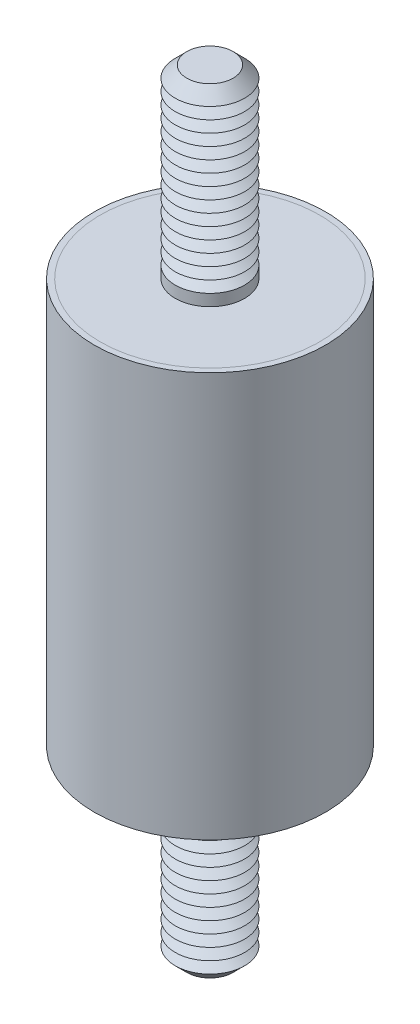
ISO-10303-21;
HEADER;
FILE_DESCRIPTION(('STEP AP214'),'2;1');
FILE_NAME('part.step','',(''),(''),'','','');
FILE_SCHEMA(('AUTOMOTIVE_DESIGN { 1 0 10303 214 1 1 1 1 }'));
ENDSEC;
DATA;
#1=APPLICATION_CONTEXT('core data for automotive mechanical design processes');
#2=APPLICATION_PROTOCOL_DEFINITION('international standard','automotive_design',2000,#1);
#3=PRODUCT_CONTEXT('',#1,'mechanical');
#4=PRODUCT('Part','Part','',(#3));
#5=PRODUCT_RELATED_PRODUCT_CATEGORY('part','',(#4));
#6=PRODUCT_DEFINITION_FORMATION('','',#4);
#7=PRODUCT_DEFINITION_CONTEXT('part definition',#1,'design');
#8=PRODUCT_DEFINITION('design','',#6,#7);
#9=PRODUCT_DEFINITION_SHAPE('','',#8);
#10=(LENGTH_UNIT() NAMED_UNIT(*) SI_UNIT(.MILLI.,.METRE.));
#11=(NAMED_UNIT(*) PLANE_ANGLE_UNIT() SI_UNIT($,.RADIAN.));
#12=(NAMED_UNIT(*) SI_UNIT($,.STERADIAN.) SOLID_ANGLE_UNIT());
#13=UNCERTAINTY_MEASURE_WITH_UNIT(LENGTH_MEASURE(1.E-05),#10,'distance_accuracy_value','');
#14=(GEOMETRIC_REPRESENTATION_CONTEXT(3) GLOBAL_UNCERTAINTY_ASSIGNED_CONTEXT((#13)) GLOBAL_UNIT_ASSIGNED_CONTEXT((#10,
#11,#12)) REPRESENTATION_CONTEXT('',''));
#15=CARTESIAN_POINT('',(0.,0.,0.));
#16=DIRECTION('',(0.,0.,1.));
#17=DIRECTION('',(1.,0.,0.));
#18=AXIS2_PLACEMENT_3D('',#15,#16,#17);
#19=CARTESIAN_POINT('',(0.,-33.5,0.));
#20=DIRECTION('',(0.,1.,0.));
#21=DIRECTION('',(0.,0.,1.));
#22=AXIS2_PLACEMENT_3D('',#19,#20,#21);
#23=CYLINDRICAL_SURFACE('',#22,3.);
#24=CARTESIAN_POINT('',(0.,-17.5,0.));
#25=DIRECTION('',(0.,-1.,0.));
#26=DIRECTION('',(0.,0.,-1.));
#27=AXIS2_PLACEMENT_3D('',#24,#25,#26);
#28=CIRCLE('',#27,3.);
#29=CARTESIAN_POINT('',(0.,-17.5,-3.));
#30=VERTEX_POINT('',#29);
#31=EDGE_CURVE('P0_E21',#30,#30,#28,.T.);
#32=ORIENTED_EDGE('',*,*,#31,.T.);
#33=EDGE_LOOP('',(#32));
#34=FACE_BOUND('',#33,.T.);
#35=CARTESIAN_POINT('',(0.,-18.5,0.));
#36=DIRECTION('',(0.,1.,0.));
#37=DIRECTION('',(0.,0.,1.));
#38=AXIS2_PLACEMENT_3D('',#35,#36,#37);
#39=CIRCLE('',#38,3.);
#40=CARTESIAN_POINT('',(0.,-18.5,3.));
#41=VERTEX_POINT('',#40);
#42=EDGE_CURVE('P0_E33',#41,#41,#39,.T.);
#43=ORIENTED_EDGE('',*,*,#42,.T.);
#44=EDGE_LOOP('',(#43));
#45=FACE_BOUND('',#44,.T.);
#46=ADVANCED_FACE('P0_F14',(#34,#45),#23,.T.);
#47=CARTESIAN_POINT('',(0.,-17.5,0.));
#48=DIRECTION('',(0.,1.,0.));
#49=DIRECTION('',(0.,0.,1.));
#50=AXIS2_PLACEMENT_3D('',#47,#48,#49);
#51=CYLINDRICAL_SURFACE('',#50,9.5);
#52=CARTESIAN_POINT('',(0.,-17.5,0.));
#53=DIRECTION('',(0.,1.,0.));
#54=DIRECTION('',(0.,0.,1.));
#55=AXIS2_PLACEMENT_3D('',#52,#53,#54);
#56=CIRCLE('',#55,9.5);
#57=CARTESIAN_POINT('',(0.,-17.5,9.5));
#58=VERTEX_POINT('',#57);
#59=EDGE_CURVE('P0_E25',#58,#58,#56,.T.);
#60=ORIENTED_EDGE('',*,*,#59,.T.);
#61=EDGE_LOOP('',(#60));
#62=FACE_BOUND('',#61,.T.);
#63=CARTESIAN_POINT('',(0.,-16.,0.));
#64=DIRECTION('',(0.,1.,0.));
#65=DIRECTION('',(0.,0.,1.));
#66=AXIS2_PLACEMENT_3D('',#63,#64,#65);
#67=CIRCLE('',#66,9.5);
#68=CARTESIAN_POINT('',(0.,-16.,9.5));
#69=VERTEX_POINT('',#68);
#70=EDGE_CURVE('P0_E30',#69,#69,#67,.T.);
#71=ORIENTED_EDGE('',*,*,#70,.F.);
#72=EDGE_LOOP('',(#71));
#73=FACE_BOUND('',#72,.T.);
#74=ADVANCED_FACE('P0_F145',(#62,#73),#51,.T.);
#75=CARTESIAN_POINT('',(0.,-17.5,0.));
#76=DIRECTION('',(0.,1.,0.));
#77=DIRECTION('',(0.,0.,1.));
#78=AXIS2_PLACEMENT_3D('',#75,#76,#77);
#79=PLANE('',#78);
#80=ORIENTED_EDGE('',*,*,#31,.F.);
#81=EDGE_LOOP('',(#80));
#82=FACE_BOUND('',#81,.T.);
#83=ORIENTED_EDGE('',*,*,#59,.F.);
#84=EDGE_LOOP('',(#83));
#85=FACE_BOUND('',#84,.T.);
#86=ADVANCED_FACE('P0_F150',(#82,#85),#79,.F.);
#87=CARTESIAN_POINT('',(0.,-16.,0.));
#88=DIRECTION('',(0.,1.,0.));
#89=DIRECTION('',(0.,0.,1.));
#90=AXIS2_PLACEMENT_3D('',#87,#88,#89);
#91=PLANE('',#90);
#92=ORIENTED_EDGE('',*,*,#70,.T.);
#93=EDGE_LOOP('',(#92));
#94=FACE_BOUND('',#93,.T.);
#95=ADVANCED_FACE('P0_F156',(#94),#91,.T.);
#96=CARTESIAN_POINT('',(0.,-18.5,0.));
#97=DIRECTION('',(0.,1.,0.));
#98=DIRECTION('',(0.,0.,1.));
#99=AXIS2_PLACEMENT_3D('',#96,#97,#98);
#100=CONICAL_SURFACE('',#99,3.,1.0471975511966);
#101=CARTESIAN_POINT('',(0.,-19.,0.));
#102=DIRECTION('',(0.,1.,0.));
#103=DIRECTION('',(0.,0.,1.));
#104=AXIS2_PLACEMENT_3D('',#101,#102,#103);
#105=CIRCLE('',#104,2.13397459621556);
#106=CARTESIAN_POINT('',(0.,-19.,2.13397459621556));
#107=VERTEX_POINT('',#106);
#108=EDGE_CURVE('P0_E39',#107,#107,#105,.T.);
#109=ORIENTED_EDGE('',*,*,#108,.T.);
#110=EDGE_LOOP('',(#109));
#111=FACE_BOUND('',#110,.T.);
#112=ORIENTED_EDGE('',*,*,#42,.F.);
#113=EDGE_LOOP('',(#112));
#114=FACE_BOUND('',#113,.T.);
#115=ADVANCED_FACE('P0_F159',(#111,#114),#100,.T.);
#116=CARTESIAN_POINT('',(0.,-19.,0.));
#117=DIRECTION('',(0.,-1.,0.));
#118=DIRECTION('',(0.,0.,-1.));
#119=AXIS2_PLACEMENT_3D('',#116,#117,#118);
#120=CONICAL_SURFACE('',#119,2.13397459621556,1.0471975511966);
#121=CARTESIAN_POINT('',(0.,-19.5,0.));
#122=DIRECTION('',(0.,1.,0.));
#123=DIRECTION('',(0.,0.,1.));
#124=AXIS2_PLACEMENT_3D('',#121,#122,#123);
#125=CIRCLE('',#124,3.);
#126=CARTESIAN_POINT('',(0.,-19.5,3.));
#127=VERTEX_POINT('',#126);
#128=EDGE_CURVE('P0_E43',#127,#127,#125,.T.);
#129=ORIENTED_EDGE('',*,*,#128,.T.);
#130=EDGE_LOOP('',(#129));
#131=FACE_BOUND('',#130,.T.);
#132=ORIENTED_EDGE('',*,*,#108,.F.);
#133=EDGE_LOOP('',(#132));
#134=FACE_BOUND('',#133,.T.);
#135=ADVANCED_FACE('P0_F163',(#131,#134),#120,.T.);
#136=CARTESIAN_POINT('',(0.,-19.5,0.));
#137=DIRECTION('',(0.,1.,0.));
#138=DIRECTION('',(0.,0.,1.));
#139=AXIS2_PLACEMENT_3D('',#136,#137,#138);
#140=CONICAL_SURFACE('',#139,3.,1.0471975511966);
#141=CARTESIAN_POINT('',(0.,-20.,0.));
#142=DIRECTION('',(0.,1.,0.));
#143=DIRECTION('',(0.,0.,1.));
#144=AXIS2_PLACEMENT_3D('',#141,#142,#143);
#145=CIRCLE('',#144,2.13397459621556);
#146=CARTESIAN_POINT('',(0.,-20.,2.13397459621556));
#147=VERTEX_POINT('',#146);
#148=EDGE_CURVE('P0_E47',#147,#147,#145,.T.);
#149=ORIENTED_EDGE('',*,*,#148,.T.);
#150=EDGE_LOOP('',(#149));
#151=FACE_BOUND('',#150,.T.);
#152=ORIENTED_EDGE('',*,*,#128,.F.);
#153=EDGE_LOOP('',(#152));
#154=FACE_BOUND('',#153,.T.);
#155=ADVANCED_FACE('P0_F167',(#151,#154),#140,.T.);
#156=CARTESIAN_POINT('',(0.,-20.,0.));
#157=DIRECTION('',(0.,-1.,0.));
#158=DIRECTION('',(0.,0.,-1.));
#159=AXIS2_PLACEMENT_3D('',#156,#157,#158);
#160=CONICAL_SURFACE('',#159,2.13397459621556,1.0471975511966);
#161=CARTESIAN_POINT('',(0.,-20.5,0.));
#162=DIRECTION('',(0.,1.,0.));
#163=DIRECTION('',(0.,0.,1.));
#164=AXIS2_PLACEMENT_3D('',#161,#162,#163);
#165=CIRCLE('',#164,3.);
#166=CARTESIAN_POINT('',(0.,-20.5,3.));
#167=VERTEX_POINT('',#166);
#168=EDGE_CURVE('P0_E52',#167,#167,#165,.T.);
#169=ORIENTED_EDGE('',*,*,#168,.T.);
#170=EDGE_LOOP('',(#169));
#171=FACE_BOUND('',#170,.T.);
#172=ORIENTED_EDGE('',*,*,#148,.F.);
#173=EDGE_LOOP('',(#172));
#174=FACE_BOUND('',#173,.T.);
#175=ADVANCED_FACE('P0_F174',(#171,#174),#160,.T.);
#176=CARTESIAN_POINT('',(0.,-20.5,0.));
#177=DIRECTION('',(0.,1.,0.));
#178=DIRECTION('',(0.,0.,1.));
#179=AXIS2_PLACEMENT_3D('',#176,#177,#178);
#180=CONICAL_SURFACE('',#179,3.,1.0471975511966);
#181=CARTESIAN_POINT('',(0.,-21.,0.));
#182=DIRECTION('',(0.,1.,0.));
#183=DIRECTION('',(0.,0.,1.));
#184=AXIS2_PLACEMENT_3D('',#181,#182,#183);
#185=CIRCLE('',#184,2.13397459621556);
#186=CARTESIAN_POINT('',(0.,-21.,2.13397459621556));
#187=VERTEX_POINT('',#186);
#188=EDGE_CURVE('P0_E55',#187,#187,#185,.T.);
#189=ORIENTED_EDGE('',*,*,#188,.T.);
#190=EDGE_LOOP('',(#189));
#191=FACE_BOUND('',#190,.T.);
#192=ORIENTED_EDGE('',*,*,#168,.F.);
#193=EDGE_LOOP('',(#192));
#194=FACE_BOUND('',#193,.T.);
#195=ADVANCED_FACE('P0_F178',(#191,#194),#180,.T.);
#196=CARTESIAN_POINT('',(0.,-21.,0.));
#197=DIRECTION('',(0.,-1.,0.));
#198=DIRECTION('',(0.,0.,-1.));
#199=AXIS2_PLACEMENT_3D('',#196,#197,#198);
#200=CONICAL_SURFACE('',#199,2.13397459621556,1.0471975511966);
#201=CARTESIAN_POINT('',(0.,-21.5,0.));
#202=DIRECTION('',(0.,1.,0.));
#203=DIRECTION('',(0.,0.,1.));
#204=AXIS2_PLACEMENT_3D('',#201,#202,#203);
#205=CIRCLE('',#204,3.);
#206=CARTESIAN_POINT('',(0.,-21.5,3.));
#207=VERTEX_POINT('',#206);
#208=EDGE_CURVE('P0_E58',#207,#207,#205,.T.);
#209=ORIENTED_EDGE('',*,*,#208,.T.);
#210=EDGE_LOOP('',(#209));
#211=FACE_BOUND('',#210,.T.);
#212=ORIENTED_EDGE('',*,*,#188,.F.);
#213=EDGE_LOOP('',(#212));
#214=FACE_BOUND('',#213,.T.);
#215=ADVANCED_FACE('P0_F182',(#211,#214),#200,.T.);
#216=CARTESIAN_POINT('',(0.,-21.5,0.));
#217=DIRECTION('',(0.,1.,0.));
#218=DIRECTION('',(0.,0.,1.));
#219=AXIS2_PLACEMENT_3D('',#216,#217,#218);
#220=CONICAL_SURFACE('',#219,3.,1.0471975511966);
#221=CARTESIAN_POINT('',(0.,-22.,0.));
#222=DIRECTION('',(0.,1.,0.));
#223=DIRECTION('',(0.,0.,1.));
#224=AXIS2_PLACEMENT_3D('',#221,#222,#223);
#225=CIRCLE('',#224,2.13397459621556);
#226=CARTESIAN_POINT('',(0.,-22.,2.13397459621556));
#227=VERTEX_POINT('',#226);
#228=EDGE_CURVE('P0_E61',#227,#227,#225,.T.);
#229=ORIENTED_EDGE('',*,*,#228,.T.);
#230=EDGE_LOOP('',(#229));
#231=FACE_BOUND('',#230,.T.);
#232=ORIENTED_EDGE('',*,*,#208,.F.);
#233=EDGE_LOOP('',(#232));
#234=FACE_BOUND('',#233,.T.);
#235=ADVANCED_FACE('P0_F186',(#231,#234),#220,.T.);
#236=CARTESIAN_POINT('',(0.,-22.,0.));
#237=DIRECTION('',(0.,-1.,0.));
#238=DIRECTION('',(0.,0.,-1.));
#239=AXIS2_PLACEMENT_3D('',#236,#237,#238);
#240=CONICAL_SURFACE('',#239,2.13397459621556,1.0471975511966);
#241=CARTESIAN_POINT('',(0.,-22.5,0.));
#242=DIRECTION('',(0.,1.,0.));
#243=DIRECTION('',(0.,0.,1.));
#244=AXIS2_PLACEMENT_3D('',#241,#242,#243);
#245=CIRCLE('',#244,3.);
#246=CARTESIAN_POINT('',(0.,-22.5,3.));
#247=VERTEX_POINT('',#246);
#248=EDGE_CURVE('P0_E64',#247,#247,#245,.T.);
#249=ORIENTED_EDGE('',*,*,#248,.T.);
#250=EDGE_LOOP('',(#249));
#251=FACE_BOUND('',#250,.T.);
#252=ORIENTED_EDGE('',*,*,#228,.F.);
#253=EDGE_LOOP('',(#252));
#254=FACE_BOUND('',#253,.T.);
#255=ADVANCED_FACE('P0_F190',(#251,#254),#240,.T.);
#256=CARTESIAN_POINT('',(0.,-22.5,0.));
#257=DIRECTION('',(0.,1.,0.));
#258=DIRECTION('',(0.,0.,1.));
#259=AXIS2_PLACEMENT_3D('',#256,#257,#258);
#260=CONICAL_SURFACE('',#259,3.,1.0471975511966);
#261=CARTESIAN_POINT('',(0.,-23.,0.));
#262=DIRECTION('',(0.,1.,0.));
#263=DIRECTION('',(0.,0.,1.));
#264=AXIS2_PLACEMENT_3D('',#261,#262,#263);
#265=CIRCLE('',#264,2.13397459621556);
#266=CARTESIAN_POINT('',(0.,-23.,2.13397459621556));
#267=VERTEX_POINT('',#266);
#268=EDGE_CURVE('P0_E67',#267,#267,#265,.T.);
#269=ORIENTED_EDGE('',*,*,#268,.T.);
#270=EDGE_LOOP('',(#269));
#271=FACE_BOUND('',#270,.T.);
#272=ORIENTED_EDGE('',*,*,#248,.F.);
#273=EDGE_LOOP('',(#272));
#274=FACE_BOUND('',#273,.T.);
#275=ADVANCED_FACE('P0_F194',(#271,#274),#260,.T.);
#276=CARTESIAN_POINT('',(0.,-23.,0.));
#277=DIRECTION('',(0.,-1.,0.));
#278=DIRECTION('',(0.,0.,-1.));
#279=AXIS2_PLACEMENT_3D('',#276,#277,#278);
#280=CONICAL_SURFACE('',#279,2.13397459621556,1.0471975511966);
#281=CARTESIAN_POINT('',(0.,-23.5,0.));
#282=DIRECTION('',(0.,1.,0.));
#283=DIRECTION('',(0.,0.,1.));
#284=AXIS2_PLACEMENT_3D('',#281,#282,#283);
#285=CIRCLE('',#284,3.);
#286=CARTESIAN_POINT('',(0.,-23.5,3.));
#287=VERTEX_POINT('',#286);
#288=EDGE_CURVE('P0_E70',#287,#287,#285,.T.);
#289=ORIENTED_EDGE('',*,*,#288,.T.);
#290=EDGE_LOOP('',(#289));
#291=FACE_BOUND('',#290,.T.);
#292=ORIENTED_EDGE('',*,*,#268,.F.);
#293=EDGE_LOOP('',(#292));
#294=FACE_BOUND('',#293,.T.);
#295=ADVANCED_FACE('P0_F198',(#291,#294),#280,.T.);
#296=CARTESIAN_POINT('',(0.,-23.5,0.));
#297=DIRECTION('',(0.,1.,0.));
#298=DIRECTION('',(0.,0.,1.));
#299=AXIS2_PLACEMENT_3D('',#296,#297,#298);
#300=CONICAL_SURFACE('',#299,3.,1.0471975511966);
#301=CARTESIAN_POINT('',(0.,-24.,0.));
#302=DIRECTION('',(0.,1.,0.));
#303=DIRECTION('',(0.,0.,1.));
#304=AXIS2_PLACEMENT_3D('',#301,#302,#303);
#305=CIRCLE('',#304,2.13397459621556);
#306=CARTESIAN_POINT('',(0.,-24.,2.13397459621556));
#307=VERTEX_POINT('',#306);
#308=EDGE_CURVE('P0_E73',#307,#307,#305,.T.);
#309=ORIENTED_EDGE('',*,*,#308,.T.);
#310=EDGE_LOOP('',(#309));
#311=FACE_BOUND('',#310,.T.);
#312=ORIENTED_EDGE('',*,*,#288,.F.);
#313=EDGE_LOOP('',(#312));
#314=FACE_BOUND('',#313,.T.);
#315=ADVANCED_FACE('P0_F202',(#311,#314),#300,.T.);
#316=CARTESIAN_POINT('',(0.,-24.,0.));
#317=DIRECTION('',(0.,-1.,0.));
#318=DIRECTION('',(0.,0.,-1.));
#319=AXIS2_PLACEMENT_3D('',#316,#317,#318);
#320=CONICAL_SURFACE('',#319,2.13397459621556,1.0471975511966);
#321=CARTESIAN_POINT('',(0.,-24.5,0.));
#322=DIRECTION('',(0.,1.,0.));
#323=DIRECTION('',(0.,0.,1.));
#324=AXIS2_PLACEMENT_3D('',#321,#322,#323);
#325=CIRCLE('',#324,3.);
#326=CARTESIAN_POINT('',(0.,-24.5,3.));
#327=VERTEX_POINT('',#326);
#328=EDGE_CURVE('P0_E76',#327,#327,#325,.T.);
#329=ORIENTED_EDGE('',*,*,#328,.T.);
#330=EDGE_LOOP('',(#329));
#331=FACE_BOUND('',#330,.T.);
#332=ORIENTED_EDGE('',*,*,#308,.F.);
#333=EDGE_LOOP('',(#332));
#334=FACE_BOUND('',#333,.T.);
#335=ADVANCED_FACE('P0_F206',(#331,#334),#320,.T.);
#336=CARTESIAN_POINT('',(0.,-24.5,0.));
#337=DIRECTION('',(0.,1.,0.));
#338=DIRECTION('',(0.,0.,1.));
#339=AXIS2_PLACEMENT_3D('',#336,#337,#338);
#340=CONICAL_SURFACE('',#339,3.,1.0471975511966);
#341=CARTESIAN_POINT('',(0.,-25.,0.));
#342=DIRECTION('',(0.,1.,0.));
#343=DIRECTION('',(0.,0.,1.));
#344=AXIS2_PLACEMENT_3D('',#341,#342,#343);
#345=CIRCLE('',#344,2.13397459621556);
#346=CARTESIAN_POINT('',(0.,-25.,2.13397459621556));
#347=VERTEX_POINT('',#346);
#348=EDGE_CURVE('P0_E79',#347,#347,#345,.T.);
#349=ORIENTED_EDGE('',*,*,#348,.T.);
#350=EDGE_LOOP('',(#349));
#351=FACE_BOUND('',#350,.T.);
#352=ORIENTED_EDGE('',*,*,#328,.F.);
#353=EDGE_LOOP('',(#352));
#354=FACE_BOUND('',#353,.T.);
#355=ADVANCED_FACE('P0_F210',(#351,#354),#340,.T.);
#356=CARTESIAN_POINT('',(0.,-25.,0.));
#357=DIRECTION('',(0.,-1.,0.));
#358=DIRECTION('',(0.,0.,-1.));
#359=AXIS2_PLACEMENT_3D('',#356,#357,#358);
#360=CONICAL_SURFACE('',#359,2.13397459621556,1.0471975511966);
#361=CARTESIAN_POINT('',(0.,-25.5,0.));
#362=DIRECTION('',(0.,1.,0.));
#363=DIRECTION('',(0.,0.,1.));
#364=AXIS2_PLACEMENT_3D('',#361,#362,#363);
#365=CIRCLE('',#364,3.);
#366=CARTESIAN_POINT('',(0.,-25.5,3.));
#367=VERTEX_POINT('',#366);
#368=EDGE_CURVE('P0_E82',#367,#367,#365,.T.);
#369=ORIENTED_EDGE('',*,*,#368,.T.);
#370=EDGE_LOOP('',(#369));
#371=FACE_BOUND('',#370,.T.);
#372=ORIENTED_EDGE('',*,*,#348,.F.);
#373=EDGE_LOOP('',(#372));
#374=FACE_BOUND('',#373,.T.);
#375=ADVANCED_FACE('P0_F214',(#371,#374),#360,.T.);
#376=CARTESIAN_POINT('',(0.,-25.5,0.));
#377=DIRECTION('',(0.,1.,0.));
#378=DIRECTION('',(0.,0.,1.));
#379=AXIS2_PLACEMENT_3D('',#376,#377,#378);
#380=CONICAL_SURFACE('',#379,3.,1.0471975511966);
#381=CARTESIAN_POINT('',(0.,-26.,0.));
#382=DIRECTION('',(0.,1.,0.));
#383=DIRECTION('',(0.,0.,1.));
#384=AXIS2_PLACEMENT_3D('',#381,#382,#383);
#385=CIRCLE('',#384,2.13397459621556);
#386=CARTESIAN_POINT('',(0.,-26.,2.13397459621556));
#387=VERTEX_POINT('',#386);
#388=EDGE_CURVE('P0_E85',#387,#387,#385,.T.);
#389=ORIENTED_EDGE('',*,*,#388,.T.);
#390=EDGE_LOOP('',(#389));
#391=FACE_BOUND('',#390,.T.);
#392=ORIENTED_EDGE('',*,*,#368,.F.);
#393=EDGE_LOOP('',(#392));
#394=FACE_BOUND('',#393,.T.);
#395=ADVANCED_FACE('P0_F218',(#391,#394),#380,.T.);
#396=CARTESIAN_POINT('',(0.,-26.,0.));
#397=DIRECTION('',(0.,-1.,0.));
#398=DIRECTION('',(0.,0.,-1.));
#399=AXIS2_PLACEMENT_3D('',#396,#397,#398);
#400=CONICAL_SURFACE('',#399,2.13397459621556,1.0471975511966);
#401=CARTESIAN_POINT('',(0.,-26.5,0.));
#402=DIRECTION('',(0.,1.,0.));
#403=DIRECTION('',(0.,0.,1.));
#404=AXIS2_PLACEMENT_3D('',#401,#402,#403);
#405=CIRCLE('',#404,3.);
#406=CARTESIAN_POINT('',(0.,-26.5,3.));
#407=VERTEX_POINT('',#406);
#408=EDGE_CURVE('P0_E88',#407,#407,#405,.T.);
#409=ORIENTED_EDGE('',*,*,#408,.T.);
#410=EDGE_LOOP('',(#409));
#411=FACE_BOUND('',#410,.T.);
#412=ORIENTED_EDGE('',*,*,#388,.F.);
#413=EDGE_LOOP('',(#412));
#414=FACE_BOUND('',#413,.T.);
#415=ADVANCED_FACE('P0_F222',(#411,#414),#400,.T.);
#416=CARTESIAN_POINT('',(0.,-26.5,0.));
#417=DIRECTION('',(0.,1.,0.));
#418=DIRECTION('',(0.,0.,1.));
#419=AXIS2_PLACEMENT_3D('',#416,#417,#418);
#420=CONICAL_SURFACE('',#419,3.,1.0471975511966);
#421=CARTESIAN_POINT('',(0.,-27.,0.));
#422=DIRECTION('',(0.,1.,0.));
#423=DIRECTION('',(0.,0.,1.));
#424=AXIS2_PLACEMENT_3D('',#421,#422,#423);
#425=CIRCLE('',#424,2.13397459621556);
#426=CARTESIAN_POINT('',(0.,-27.,2.13397459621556));
#427=VERTEX_POINT('',#426);
#428=EDGE_CURVE('P0_E91',#427,#427,#425,.T.);
#429=ORIENTED_EDGE('',*,*,#428,.T.);
#430=EDGE_LOOP('',(#429));
#431=FACE_BOUND('',#430,.T.);
#432=ORIENTED_EDGE('',*,*,#408,.F.);
#433=EDGE_LOOP('',(#432));
#434=FACE_BOUND('',#433,.T.);
#435=ADVANCED_FACE('P0_F226',(#431,#434),#420,.T.);
#436=CARTESIAN_POINT('',(0.,-27.,0.));
#437=DIRECTION('',(0.,-1.,0.));
#438=DIRECTION('',(0.,0.,-1.));
#439=AXIS2_PLACEMENT_3D('',#436,#437,#438);
#440=CONICAL_SURFACE('',#439,2.13397459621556,1.0471975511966);
#441=CARTESIAN_POINT('',(0.,-27.5,0.));
#442=DIRECTION('',(0.,1.,0.));
#443=DIRECTION('',(0.,0.,1.));
#444=AXIS2_PLACEMENT_3D('',#441,#442,#443);
#445=CIRCLE('',#444,3.);
#446=CARTESIAN_POINT('',(0.,-27.5,3.));
#447=VERTEX_POINT('',#446);
#448=EDGE_CURVE('P0_E94',#447,#447,#445,.T.);
#449=ORIENTED_EDGE('',*,*,#448,.T.);
#450=EDGE_LOOP('',(#449));
#451=FACE_BOUND('',#450,.T.);
#452=ORIENTED_EDGE('',*,*,#428,.F.);
#453=EDGE_LOOP('',(#452));
#454=FACE_BOUND('',#453,.T.);
#455=ADVANCED_FACE('P0_F230',(#451,#454),#440,.T.);
#456=CARTESIAN_POINT('',(0.,-27.5,0.));
#457=DIRECTION('',(0.,1.,0.));
#458=DIRECTION('',(0.,0.,1.));
#459=AXIS2_PLACEMENT_3D('',#456,#457,#458);
#460=CONICAL_SURFACE('',#459,3.,1.0471975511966);
#461=CARTESIAN_POINT('',(0.,-28.,0.));
#462=DIRECTION('',(0.,1.,0.));
#463=DIRECTION('',(0.,0.,1.));
#464=AXIS2_PLACEMENT_3D('',#461,#462,#463);
#465=CIRCLE('',#464,2.13397459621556);
#466=CARTESIAN_POINT('',(0.,-28.,2.13397459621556));
#467=VERTEX_POINT('',#466);
#468=EDGE_CURVE('P0_E97',#467,#467,#465,.T.);
#469=ORIENTED_EDGE('',*,*,#468,.T.);
#470=EDGE_LOOP('',(#469));
#471=FACE_BOUND('',#470,.T.);
#472=ORIENTED_EDGE('',*,*,#448,.F.);
#473=EDGE_LOOP('',(#472));
#474=FACE_BOUND('',#473,.T.);
#475=ADVANCED_FACE('P0_F234',(#471,#474),#460,.T.);
#476=CARTESIAN_POINT('',(0.,-28.,0.));
#477=DIRECTION('',(0.,-1.,0.));
#478=DIRECTION('',(0.,0.,-1.));
#479=AXIS2_PLACEMENT_3D('',#476,#477,#478);
#480=CONICAL_SURFACE('',#479,2.13397459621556,1.0471975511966);
#481=CARTESIAN_POINT('',(0.,-28.5,0.));
#482=DIRECTION('',(0.,1.,0.));
#483=DIRECTION('',(0.,0.,1.));
#484=AXIS2_PLACEMENT_3D('',#481,#482,#483);
#485=CIRCLE('',#484,3.);
#486=CARTESIAN_POINT('',(0.,-28.5,3.));
#487=VERTEX_POINT('',#486);
#488=EDGE_CURVE('P0_E100',#487,#487,#485,.T.);
#489=ORIENTED_EDGE('',*,*,#488,.T.);
#490=EDGE_LOOP('',(#489));
#491=FACE_BOUND('',#490,.T.);
#492=ORIENTED_EDGE('',*,*,#468,.F.);
#493=EDGE_LOOP('',(#492));
#494=FACE_BOUND('',#493,.T.);
#495=ADVANCED_FACE('P0_F238',(#491,#494),#480,.T.);
#496=CARTESIAN_POINT('',(0.,-28.5,0.));
#497=DIRECTION('',(0.,1.,0.));
#498=DIRECTION('',(0.,0.,1.));
#499=AXIS2_PLACEMENT_3D('',#496,#497,#498);
#500=CONICAL_SURFACE('',#499,3.,1.0471975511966);
#501=CARTESIAN_POINT('',(0.,-29.,0.));
#502=DIRECTION('',(0.,1.,0.));
#503=DIRECTION('',(0.,0.,1.));
#504=AXIS2_PLACEMENT_3D('',#501,#502,#503);
#505=CIRCLE('',#504,2.13397459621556);
#506=CARTESIAN_POINT('',(0.,-29.,2.13397459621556));
#507=VERTEX_POINT('',#506);
#508=EDGE_CURVE('P0_E103',#507,#507,#505,.T.);
#509=ORIENTED_EDGE('',*,*,#508,.T.);
#510=EDGE_LOOP('',(#509));
#511=FACE_BOUND('',#510,.T.);
#512=ORIENTED_EDGE('',*,*,#488,.F.);
#513=EDGE_LOOP('',(#512));
#514=FACE_BOUND('',#513,.T.);
#515=ADVANCED_FACE('P0_F242',(#511,#514),#500,.T.);
#516=CARTESIAN_POINT('',(0.,-29.,0.));
#517=DIRECTION('',(0.,-1.,0.));
#518=DIRECTION('',(0.,0.,-1.));
#519=AXIS2_PLACEMENT_3D('',#516,#517,#518);
#520=CONICAL_SURFACE('',#519,2.13397459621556,1.0471975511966);
#521=CARTESIAN_POINT('',(0.,-29.5,0.));
#522=DIRECTION('',(0.,1.,0.));
#523=DIRECTION('',(0.,0.,1.));
#524=AXIS2_PLACEMENT_3D('',#521,#522,#523);
#525=CIRCLE('',#524,3.);
#526=CARTESIAN_POINT('',(0.,-29.5,3.));
#527=VERTEX_POINT('',#526);
#528=EDGE_CURVE('P0_E106',#527,#527,#525,.T.);
#529=ORIENTED_EDGE('',*,*,#528,.T.);
#530=EDGE_LOOP('',(#529));
#531=FACE_BOUND('',#530,.T.);
#532=ORIENTED_EDGE('',*,*,#508,.F.);
#533=EDGE_LOOP('',(#532));
#534=FACE_BOUND('',#533,.T.);
#535=ADVANCED_FACE('P0_F246',(#531,#534),#520,.T.);
#536=CARTESIAN_POINT('',(0.,-29.5,0.));
#537=DIRECTION('',(0.,1.,0.));
#538=DIRECTION('',(0.,0.,1.));
#539=AXIS2_PLACEMENT_3D('',#536,#537,#538);
#540=CONICAL_SURFACE('',#539,3.,1.0471975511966);
#541=CARTESIAN_POINT('',(0.,-30.,0.));
#542=DIRECTION('',(0.,1.,0.));
#543=DIRECTION('',(0.,0.,1.));
#544=AXIS2_PLACEMENT_3D('',#541,#542,#543);
#545=CIRCLE('',#544,2.13397459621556);
#546=CARTESIAN_POINT('',(0.,-30.,2.13397459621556));
#547=VERTEX_POINT('',#546);
#548=EDGE_CURVE('P0_E109',#547,#547,#545,.T.);
#549=ORIENTED_EDGE('',*,*,#548,.T.);
#550=EDGE_LOOP('',(#549));
#551=FACE_BOUND('',#550,.T.);
#552=ORIENTED_EDGE('',*,*,#528,.F.);
#553=EDGE_LOOP('',(#552));
#554=FACE_BOUND('',#553,.T.);
#555=ADVANCED_FACE('P0_F250',(#551,#554),#540,.T.);
#556=CARTESIAN_POINT('',(0.,-30.,0.));
#557=DIRECTION('',(0.,-1.,0.));
#558=DIRECTION('',(0.,0.,-1.));
#559=AXIS2_PLACEMENT_3D('',#556,#557,#558);
#560=CONICAL_SURFACE('',#559,2.13397459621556,1.0471975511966);
#561=CARTESIAN_POINT('',(0.,-30.5,0.));
#562=DIRECTION('',(0.,1.,0.));
#563=DIRECTION('',(0.,0.,1.));
#564=AXIS2_PLACEMENT_3D('',#561,#562,#563);
#565=CIRCLE('',#564,3.);
#566=CARTESIAN_POINT('',(0.,-30.5,3.));
#567=VERTEX_POINT('',#566);
#568=EDGE_CURVE('P0_E112',#567,#567,#565,.T.);
#569=ORIENTED_EDGE('',*,*,#568,.T.);
#570=EDGE_LOOP('',(#569));
#571=FACE_BOUND('',#570,.T.);
#572=ORIENTED_EDGE('',*,*,#548,.F.);
#573=EDGE_LOOP('',(#572));
#574=FACE_BOUND('',#573,.T.);
#575=ADVANCED_FACE('P0_F254',(#571,#574),#560,.T.);
#576=CARTESIAN_POINT('',(0.,-30.5,0.));
#577=DIRECTION('',(0.,1.,0.));
#578=DIRECTION('',(0.,0.,1.));
#579=AXIS2_PLACEMENT_3D('',#576,#577,#578);
#580=CONICAL_SURFACE('',#579,3.,1.0471975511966);
#581=CARTESIAN_POINT('',(0.,-31.,0.));
#582=DIRECTION('',(0.,1.,0.));
#583=DIRECTION('',(0.,0.,1.));
#584=AXIS2_PLACEMENT_3D('',#581,#582,#583);
#585=CIRCLE('',#584,2.13397459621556);
#586=CARTESIAN_POINT('',(0.,-31.,2.13397459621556));
#587=VERTEX_POINT('',#586);
#588=EDGE_CURVE('P0_E115',#587,#587,#585,.T.);
#589=ORIENTED_EDGE('',*,*,#588,.T.);
#590=EDGE_LOOP('',(#589));
#591=FACE_BOUND('',#590,.T.);
#592=ORIENTED_EDGE('',*,*,#568,.F.);
#593=EDGE_LOOP('',(#592));
#594=FACE_BOUND('',#593,.T.);
#595=ADVANCED_FACE('P0_F258',(#591,#594),#580,.T.);
#596=CARTESIAN_POINT('',(0.,-31.,0.));
#597=DIRECTION('',(0.,-1.,0.));
#598=DIRECTION('',(0.,0.,-1.));
#599=AXIS2_PLACEMENT_3D('',#596,#597,#598);
#600=CONICAL_SURFACE('',#599,2.13397459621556,1.0471975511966);
#601=CARTESIAN_POINT('',(0.,-31.5,0.));
#602=DIRECTION('',(0.,1.,0.));
#603=DIRECTION('',(0.,0.,1.));
#604=AXIS2_PLACEMENT_3D('',#601,#602,#603);
#605=CIRCLE('',#604,3.);
#606=CARTESIAN_POINT('',(0.,-31.5,3.));
#607=VERTEX_POINT('',#606);
#608=EDGE_CURVE('P0_E118',#607,#607,#605,.T.);
#609=ORIENTED_EDGE('',*,*,#608,.T.);
#610=EDGE_LOOP('',(#609));
#611=FACE_BOUND('',#610,.T.);
#612=ORIENTED_EDGE('',*,*,#588,.F.);
#613=EDGE_LOOP('',(#612));
#614=FACE_BOUND('',#613,.T.);
#615=ADVANCED_FACE('P0_F142',(#611,#614),#600,.T.);
#616=CARTESIAN_POINT('',(0.,-31.5,0.));
#617=DIRECTION('',(0.,1.,0.));
#618=DIRECTION('',(0.,0.,1.));
#619=AXIS2_PLACEMENT_3D('',#616,#617,#618);
#620=CONICAL_SURFACE('',#619,3.,1.0471975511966);
#621=CARTESIAN_POINT('',(0.,-32.,0.));
#622=DIRECTION('',(0.,1.,0.));
#623=DIRECTION('',(0.,0.,1.));
#624=AXIS2_PLACEMENT_3D('',#621,#622,#623);
#625=CIRCLE('',#624,2.13397459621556);
#626=CARTESIAN_POINT('',(0.,-32.,2.13397459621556));
#627=VERTEX_POINT('',#626);
#628=EDGE_CURVE('P0_E124',#627,#627,#625,.T.);
#629=ORIENTED_EDGE('',*,*,#628,.T.);
#630=EDGE_LOOP('',(#629));
#631=FACE_BOUND('',#630,.T.);
#632=ORIENTED_EDGE('',*,*,#608,.F.);
#633=EDGE_LOOP('',(#632));
#634=FACE_BOUND('',#633,.T.);
#635=ADVANCED_FACE('P0_F128',(#631,#634),#620,.T.);
#636=CARTESIAN_POINT('',(0.,-32.,0.));
#637=DIRECTION('',(0.,-1.,0.));
#638=DIRECTION('',(0.,0.,-1.));
#639=AXIS2_PLACEMENT_3D('',#636,#637,#638);
#640=CONICAL_SURFACE('',#639,2.13397459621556,1.0471975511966);
#641=CARTESIAN_POINT('',(0.,-32.5,0.));
#642=DIRECTION('',(0.,1.,0.));
#643=DIRECTION('',(0.,0.,1.));
#644=AXIS2_PLACEMENT_3D('',#641,#642,#643);
#645=CIRCLE('',#644,3.);
#646=CARTESIAN_POINT('',(0.,-32.5,3.));
#647=VERTEX_POINT('',#646);
#648=EDGE_CURVE('P0_E121',#647,#647,#645,.T.);
#649=ORIENTED_EDGE('',*,*,#648,.T.);
#650=EDGE_LOOP('',(#649));
#651=FACE_BOUND('',#650,.T.);
#652=ORIENTED_EDGE('',*,*,#628,.F.);
#653=EDGE_LOOP('',(#652));
#654=FACE_BOUND('',#653,.T.);
#655=ADVANCED_FACE('P0_F131',(#651,#654),#640,.T.);
#656=CARTESIAN_POINT('',(0.,-33.5,0.));
#657=DIRECTION('',(0.,-1.,0.));
#658=DIRECTION('',(0.,0.,-1.));
#659=AXIS2_PLACEMENT_3D('',#656,#657,#658);
#660=PLANE('',#659);
#661=CARTESIAN_POINT('',(0.,-33.5,0.));
#662=DIRECTION('',(0.,-1.,0.));
#663=DIRECTION('',(0.,0.,-1.));
#664=AXIS2_PLACEMENT_3D('',#661,#662,#663);
#665=CIRCLE('',#664,2.);
#666=CARTESIAN_POINT('',(0.,-33.5,-2.));
#667=VERTEX_POINT('',#666);
#668=EDGE_CURVE('P0_E10',#667,#667,#665,.T.);
#669=ORIENTED_EDGE('',*,*,#668,.T.);
#670=EDGE_LOOP('',(#669));
#671=FACE_BOUND('',#670,.T.);
#672=ADVANCED_FACE('P0_F133',(#671),#660,.T.);
#673=CARTESIAN_POINT('',(0.,-33.5,0.));
#674=DIRECTION('',(0.,1.,0.));
#675=DIRECTION('',(0.,0.,1.));
#676=AXIS2_PLACEMENT_3D('',#673,#674,#675);
#677=CONICAL_SURFACE('',#676,2.,0.785398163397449);
#678=ORIENTED_EDGE('',*,*,#648,.F.);
#679=EDGE_LOOP('',(#678));
#680=FACE_BOUND('',#679,.T.);
#681=ORIENTED_EDGE('',*,*,#668,.F.);
#682=EDGE_LOOP('',(#681));
#683=FACE_BOUND('',#682,.T.);
#684=ADVANCED_FACE('P0_F16',(#680,#683),#677,.T.);
#685=CLOSED_SHELL('',(#46,#74,#86,#95,#115,#135,#155,#175,#195,#215,#235,#255,#275,#295,#315,
#335,#355,#375,#395,#415,#435,#455,#475,#495,#515,#535,#555,#575,#595,#615,#635,#655,#672,#684));
#686=MANIFOLD_SOLID_BREP('P0_B1',#685);
#687=CARTESIAN_POINT('',(0.,33.5,0.));
#688=DIRECTION('',(0.,-1.,0.));
#689=DIRECTION('',(0.,0.,-1.));
#690=AXIS2_PLACEMENT_3D('',#687,#688,#689);
#691=CYLINDRICAL_SURFACE('',#690,3.);
#692=CARTESIAN_POINT('',(0.,18.5,0.));
#693=DIRECTION('',(0.,1.,0.));
#694=DIRECTION('',(0.,0.,1.));
#695=AXIS2_PLACEMENT_3D('',#692,#693,#694);
#696=CIRCLE('',#695,3.);
#697=CARTESIAN_POINT('',(0.,18.5,3.));
#698=VERTEX_POINT('',#697);
#699=EDGE_CURVE('P1_E33',#698,#698,#696,.T.);
#700=ORIENTED_EDGE('',*,*,#699,.F.);
#701=EDGE_LOOP('',(#700));
#702=FACE_BOUND('',#701,.T.);
#703=CARTESIAN_POINT('',(0.,17.5,0.));
#704=DIRECTION('',(0.,1.,0.));
#705=DIRECTION('',(0.,0.,1.));
#706=AXIS2_PLACEMENT_3D('',#703,#704,#705);
#707=CIRCLE('',#706,3.);
#708=CARTESIAN_POINT('',(0.,17.5,3.));
#709=VERTEX_POINT('',#708);
#710=EDGE_CURVE('P1_E21',#709,#709,#707,.T.);
#711=ORIENTED_EDGE('',*,*,#710,.T.);
#712=EDGE_LOOP('',(#711));
#713=FACE_BOUND('',#712,.T.);
#714=ADVANCED_FACE('P1_F14',(#702,#713),#691,.T.);
#715=CARTESIAN_POINT('',(0.,17.5,0.));
#716=DIRECTION('',(0.,-1.,0.));
#717=DIRECTION('',(0.,0.,-1.));
#718=AXIS2_PLACEMENT_3D('',#715,#716,#717);
#719=CYLINDRICAL_SURFACE('',#718,9.5);
#720=CARTESIAN_POINT('',(0.,17.5,0.));
#721=DIRECTION('',(0.,1.,0.));
#722=DIRECTION('',(0.,0.,1.));
#723=AXIS2_PLACEMENT_3D('',#720,#721,#722);
#724=CIRCLE('',#723,9.5);
#725=CARTESIAN_POINT('',(0.,17.5,9.5));
#726=VERTEX_POINT('',#725);
#727=EDGE_CURVE('P1_E25',#726,#726,#724,.T.);
#728=ORIENTED_EDGE('',*,*,#727,.F.);
#729=EDGE_LOOP('',(#728));
#730=FACE_BOUND('',#729,.T.);
#731=CARTESIAN_POINT('',(0.,16.,0.));
#732=DIRECTION('',(0.,1.,0.));
#733=DIRECTION('',(0.,0.,1.));
#734=AXIS2_PLACEMENT_3D('',#731,#732,#733);
#735=CIRCLE('',#734,9.5);
#736=CARTESIAN_POINT('',(0.,16.,9.5));
#737=VERTEX_POINT('',#736);
#738=EDGE_CURVE('P1_E30',#737,#737,#735,.T.);
#739=ORIENTED_EDGE('',*,*,#738,.T.);
#740=EDGE_LOOP('',(#739));
#741=FACE_BOUND('',#740,.T.);
#742=ADVANCED_FACE('P1_F292',(#730,#741),#719,.T.);
#743=CARTESIAN_POINT('',(0.,17.5,0.));
#744=DIRECTION('',(0.,1.,0.));
#745=DIRECTION('',(0.,0.,1.));
#746=AXIS2_PLACEMENT_3D('',#743,#744,#745);
#747=PLANE('',#746);
#748=ORIENTED_EDGE('',*,*,#710,.F.);
#749=EDGE_LOOP('',(#748));
#750=FACE_BOUND('',#749,.T.);
#751=ORIENTED_EDGE('',*,*,#727,.T.);
#752=EDGE_LOOP('',(#751));
#753=FACE_BOUND('',#752,.T.);
#754=ADVANCED_FACE('P1_F298',(#750,#753),#747,.T.);
#755=CARTESIAN_POINT('',(0.,16.,0.));
#756=DIRECTION('',(0.,1.,0.));
#757=DIRECTION('',(0.,0.,1.));
#758=AXIS2_PLACEMENT_3D('',#755,#756,#757);
#759=PLANE('',#758);
#760=ORIENTED_EDGE('',*,*,#738,.F.);
#761=EDGE_LOOP('',(#760));
#762=FACE_BOUND('',#761,.T.);
#763=ADVANCED_FACE('P1_F288',(#762),#759,.F.);
#764=CARTESIAN_POINT('',(0.,18.5,0.));
#765=DIRECTION('',(0.,-1.,0.));
#766=DIRECTION('',(0.,0.,-1.));
#767=AXIS2_PLACEMENT_3D('',#764,#765,#766);
#768=CONICAL_SURFACE('',#767,3.,1.0471975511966);
#769=CARTESIAN_POINT('',(0.,19.,0.));
#770=DIRECTION('',(0.,1.,0.));
#771=DIRECTION('',(0.,0.,1.));
#772=AXIS2_PLACEMENT_3D('',#769,#770,#771);
#773=CIRCLE('',#772,2.13397459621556);
#774=CARTESIAN_POINT('',(0.,19.,2.13397459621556));
#775=VERTEX_POINT('',#774);
#776=EDGE_CURVE('P1_E39',#775,#775,#773,.T.);
#777=ORIENTED_EDGE('',*,*,#776,.F.);
#778=EDGE_LOOP('',(#777));
#779=FACE_BOUND('',#778,.T.);
#780=ORIENTED_EDGE('',*,*,#699,.T.);
#781=EDGE_LOOP('',(#780));
#782=FACE_BOUND('',#781,.T.);
#783=ADVANCED_FACE('P1_F282',(#779,#782),#768,.T.);
#784=CARTESIAN_POINT('',(0.,19.,0.));
#785=DIRECTION('',(0.,1.,0.));
#786=DIRECTION('',(0.,0.,1.));
#787=AXIS2_PLACEMENT_3D('',#784,#785,#786);
#788=CONICAL_SURFACE('',#787,2.13397459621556,1.0471975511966);
#789=CARTESIAN_POINT('',(0.,19.5,0.));
#790=DIRECTION('',(0.,1.,0.));
#791=DIRECTION('',(0.,0.,1.));
#792=AXIS2_PLACEMENT_3D('',#789,#790,#791);
#793=CIRCLE('',#792,3.);
#794=CARTESIAN_POINT('',(0.,19.5,3.));
#795=VERTEX_POINT('',#794);
#796=EDGE_CURVE('P1_E43',#795,#795,#793,.T.);
#797=ORIENTED_EDGE('',*,*,#796,.F.);
#798=EDGE_LOOP('',(#797));
#799=FACE_BOUND('',#798,.T.);
#800=ORIENTED_EDGE('',*,*,#776,.T.);
#801=EDGE_LOOP('',(#800));
#802=FACE_BOUND('',#801,.T.);
#803=ADVANCED_FACE('P1_F277',(#799,#802),#788,.T.);
#804=CARTESIAN_POINT('',(0.,19.5,0.));
#805=DIRECTION('',(0.,-1.,0.));
#806=DIRECTION('',(0.,0.,-1.));
#807=AXIS2_PLACEMENT_3D('',#804,#805,#806);
#808=CONICAL_SURFACE('',#807,3.,1.0471975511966);
#809=CARTESIAN_POINT('',(0.,20.,0.));
#810=DIRECTION('',(0.,1.,0.));
#811=DIRECTION('',(0.,0.,1.));
#812=AXIS2_PLACEMENT_3D('',#809,#810,#811);
#813=CIRCLE('',#812,2.13397459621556);
#814=CARTESIAN_POINT('',(0.,20.,2.13397459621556));
#815=VERTEX_POINT('',#814);
#816=EDGE_CURVE('P1_E47',#815,#815,#813,.T.);
#817=ORIENTED_EDGE('',*,*,#816,.F.);
#818=EDGE_LOOP('',(#817));
#819=FACE_BOUND('',#818,.T.);
#820=ORIENTED_EDGE('',*,*,#796,.T.);
#821=EDGE_LOOP('',(#820));
#822=FACE_BOUND('',#821,.T.);
#823=ADVANCED_FACE('P1_F271',(#819,#822),#808,.T.);
#824=CARTESIAN_POINT('',(0.,20.,0.));
#825=DIRECTION('',(0.,1.,0.));
#826=DIRECTION('',(0.,0.,1.));
#827=AXIS2_PLACEMENT_3D('',#824,#825,#826);
#828=CONICAL_SURFACE('',#827,2.13397459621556,1.0471975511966);
#829=CARTESIAN_POINT('',(0.,20.5,0.));
#830=DIRECTION('',(0.,1.,0.));
#831=DIRECTION('',(0.,0.,1.));
#832=AXIS2_PLACEMENT_3D('',#829,#830,#831);
#833=CIRCLE('',#832,3.);
#834=CARTESIAN_POINT('',(0.,20.5,3.));
#835=VERTEX_POINT('',#834);
#836=EDGE_CURVE('P1_E52',#835,#835,#833,.T.);
#837=ORIENTED_EDGE('',*,*,#836,.F.);
#838=EDGE_LOOP('',(#837));
#839=FACE_BOUND('',#838,.T.);
#840=ORIENTED_EDGE('',*,*,#816,.T.);
#841=EDGE_LOOP('',(#840));
#842=FACE_BOUND('',#841,.T.);
#843=ADVANCED_FACE('P1_F265',(#839,#842),#828,.T.);
#844=CARTESIAN_POINT('',(0.,20.5,0.));
#845=DIRECTION('',(0.,-1.,0.));
#846=DIRECTION('',(0.,0.,-1.));
#847=AXIS2_PLACEMENT_3D('',#844,#845,#846);
#848=CONICAL_SURFACE('',#847,3.,1.0471975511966);
#849=CARTESIAN_POINT('',(0.,21.,0.));
#850=DIRECTION('',(0.,1.,0.));
#851=DIRECTION('',(0.,0.,1.));
#852=AXIS2_PLACEMENT_3D('',#849,#850,#851);
#853=CIRCLE('',#852,2.13397459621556);
#854=CARTESIAN_POINT('',(0.,21.,2.13397459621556));
#855=VERTEX_POINT('',#854);
#856=EDGE_CURVE('P1_E55',#855,#855,#853,.T.);
#857=ORIENTED_EDGE('',*,*,#856,.F.);
#858=EDGE_LOOP('',(#857));
#859=FACE_BOUND('',#858,.T.);
#860=ORIENTED_EDGE('',*,*,#836,.T.);
#861=EDGE_LOOP('',(#860));
#862=FACE_BOUND('',#861,.T.);
#863=ADVANCED_FACE('P1_F259',(#859,#862),#848,.T.);
#864=CARTESIAN_POINT('',(0.,21.,0.));
#865=DIRECTION('',(0.,1.,0.));
#866=DIRECTION('',(0.,0.,1.));
#867=AXIS2_PLACEMENT_3D('',#864,#865,#866);
#868=CONICAL_SURFACE('',#867,2.13397459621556,1.0471975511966);
#869=CARTESIAN_POINT('',(0.,21.5,0.));
#870=DIRECTION('',(0.,1.,0.));
#871=DIRECTION('',(0.,0.,1.));
#872=AXIS2_PLACEMENT_3D('',#869,#870,#871);
#873=CIRCLE('',#872,3.);
#874=CARTESIAN_POINT('',(0.,21.5,3.));
#875=VERTEX_POINT('',#874);
#876=EDGE_CURVE('P1_E58',#875,#875,#873,.T.);
#877=ORIENTED_EDGE('',*,*,#876,.F.);
#878=EDGE_LOOP('',(#877));
#879=FACE_BOUND('',#878,.T.);
#880=ORIENTED_EDGE('',*,*,#856,.T.);
#881=EDGE_LOOP('',(#880));
#882=FACE_BOUND('',#881,.T.);
#883=ADVANCED_FACE('P1_F253',(#879,#882),#868,.T.);
#884=CARTESIAN_POINT('',(0.,21.5,0.));
#885=DIRECTION('',(0.,-1.,0.));
#886=DIRECTION('',(0.,0.,-1.));
#887=AXIS2_PLACEMENT_3D('',#884,#885,#886);
#888=CONICAL_SURFACE('',#887,3.,1.0471975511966);
#889=CARTESIAN_POINT('',(0.,22.,0.));
#890=DIRECTION('',(0.,1.,0.));
#891=DIRECTION('',(0.,0.,1.));
#892=AXIS2_PLACEMENT_3D('',#889,#890,#891);
#893=CIRCLE('',#892,2.13397459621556);
#894=CARTESIAN_POINT('',(0.,22.,2.13397459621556));
#895=VERTEX_POINT('',#894);
#896=EDGE_CURVE('P1_E61',#895,#895,#893,.T.);
#897=ORIENTED_EDGE('',*,*,#896,.F.);
#898=EDGE_LOOP('',(#897));
#899=FACE_BOUND('',#898,.T.);
#900=ORIENTED_EDGE('',*,*,#876,.T.);
#901=EDGE_LOOP('',(#900));
#902=FACE_BOUND('',#901,.T.);
#903=ADVANCED_FACE('P1_F247',(#899,#902),#888,.T.);
#904=CARTESIAN_POINT('',(0.,22.,0.));
#905=DIRECTION('',(0.,1.,0.));
#906=DIRECTION('',(0.,0.,1.));
#907=AXIS2_PLACEMENT_3D('',#904,#905,#906);
#908=CONICAL_SURFACE('',#907,2.13397459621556,1.0471975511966);
#909=CARTESIAN_POINT('',(0.,22.5,0.));
#910=DIRECTION('',(0.,1.,0.));
#911=DIRECTION('',(0.,0.,1.));
#912=AXIS2_PLACEMENT_3D('',#909,#910,#911);
#913=CIRCLE('',#912,3.);
#914=CARTESIAN_POINT('',(0.,22.5,3.));
#915=VERTEX_POINT('',#914);
#916=EDGE_CURVE('P1_E64',#915,#915,#913,.T.);
#917=ORIENTED_EDGE('',*,*,#916,.F.);
#918=EDGE_LOOP('',(#917));
#919=FACE_BOUND('',#918,.T.);
#920=ORIENTED_EDGE('',*,*,#896,.T.);
#921=EDGE_LOOP('',(#920));
#922=FACE_BOUND('',#921,.T.);
#923=ADVANCED_FACE('P1_F241',(#919,#922),#908,.T.);
#924=CARTESIAN_POINT('',(0.,22.5,0.));
#925=DIRECTION('',(0.,-1.,0.));
#926=DIRECTION('',(0.,0.,-1.));
#927=AXIS2_PLACEMENT_3D('',#924,#925,#926);
#928=CONICAL_SURFACE('',#927,3.,1.0471975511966);
#929=CARTESIAN_POINT('',(0.,23.,0.));
#930=DIRECTION('',(0.,1.,0.));
#931=DIRECTION('',(0.,0.,1.));
#932=AXIS2_PLACEMENT_3D('',#929,#930,#931);
#933=CIRCLE('',#932,2.13397459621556);
#934=CARTESIAN_POINT('',(0.,23.,2.13397459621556));
#935=VERTEX_POINT('',#934);
#936=EDGE_CURVE('P1_E67',#935,#935,#933,.T.);
#937=ORIENTED_EDGE('',*,*,#936,.F.);
#938=EDGE_LOOP('',(#937));
#939=FACE_BOUND('',#938,.T.);
#940=ORIENTED_EDGE('',*,*,#916,.T.);
#941=EDGE_LOOP('',(#940));
#942=FACE_BOUND('',#941,.T.);
#943=ADVANCED_FACE('P1_F235',(#939,#942),#928,.T.);
#944=CARTESIAN_POINT('',(0.,23.,0.));
#945=DIRECTION('',(0.,1.,0.));
#946=DIRECTION('',(0.,0.,1.));
#947=AXIS2_PLACEMENT_3D('',#944,#945,#946);
#948=CONICAL_SURFACE('',#947,2.13397459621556,1.0471975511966);
#949=CARTESIAN_POINT('',(0.,23.5,0.));
#950=DIRECTION('',(0.,1.,0.));
#951=DIRECTION('',(0.,0.,1.));
#952=AXIS2_PLACEMENT_3D('',#949,#950,#951);
#953=CIRCLE('',#952,3.);
#954=CARTESIAN_POINT('',(0.,23.5,3.));
#955=VERTEX_POINT('',#954);
#956=EDGE_CURVE('P1_E70',#955,#955,#953,.T.);
#957=ORIENTED_EDGE('',*,*,#956,.F.);
#958=EDGE_LOOP('',(#957));
#959=FACE_BOUND('',#958,.T.);
#960=ORIENTED_EDGE('',*,*,#936,.T.);
#961=EDGE_LOOP('',(#960));
#962=FACE_BOUND('',#961,.T.);
#963=ADVANCED_FACE('P1_F229',(#959,#962),#948,.T.);
#964=CARTESIAN_POINT('',(0.,23.5,0.));
#965=DIRECTION('',(0.,-1.,0.));
#966=DIRECTION('',(0.,0.,-1.));
#967=AXIS2_PLACEMENT_3D('',#964,#965,#966);
#968=CONICAL_SURFACE('',#967,3.,1.0471975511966);
#969=CARTESIAN_POINT('',(0.,24.,0.));
#970=DIRECTION('',(0.,1.,0.));
#971=DIRECTION('',(0.,0.,1.));
#972=AXIS2_PLACEMENT_3D('',#969,#970,#971);
#973=CIRCLE('',#972,2.13397459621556);
#974=CARTESIAN_POINT('',(0.,24.,2.13397459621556));
#975=VERTEX_POINT('',#974);
#976=EDGE_CURVE('P1_E73',#975,#975,#973,.T.);
#977=ORIENTED_EDGE('',*,*,#976,.F.);
#978=EDGE_LOOP('',(#977));
#979=FACE_BOUND('',#978,.T.);
#980=ORIENTED_EDGE('',*,*,#956,.T.);
#981=EDGE_LOOP('',(#980));
#982=FACE_BOUND('',#981,.T.);
#983=ADVANCED_FACE('P1_F223',(#979,#982),#968,.T.);
#984=CARTESIAN_POINT('',(0.,24.,0.));
#985=DIRECTION('',(0.,1.,0.));
#986=DIRECTION('',(0.,0.,1.));
#987=AXIS2_PLACEMENT_3D('',#984,#985,#986);
#988=CONICAL_SURFACE('',#987,2.13397459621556,1.0471975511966);
#989=CARTESIAN_POINT('',(0.,24.5,0.));
#990=DIRECTION('',(0.,1.,0.));
#991=DIRECTION('',(0.,0.,1.));
#992=AXIS2_PLACEMENT_3D('',#989,#990,#991);
#993=CIRCLE('',#992,3.);
#994=CARTESIAN_POINT('',(0.,24.5,3.));
#995=VERTEX_POINT('',#994);
#996=EDGE_CURVE('P1_E76',#995,#995,#993,.T.);
#997=ORIENTED_EDGE('',*,*,#996,.F.);
#998=EDGE_LOOP('',(#997));
#999=FACE_BOUND('',#998,.T.);
#1000=ORIENTED_EDGE('',*,*,#976,.T.);
#1001=EDGE_LOOP('',(#1000));
#1002=FACE_BOUND('',#1001,.T.);
#1003=ADVANCED_FACE('P1_F217',(#999,#1002),#988,.T.);
#1004=CARTESIAN_POINT('',(0.,24.5,0.));
#1005=DIRECTION('',(0.,-1.,0.));
#1006=DIRECTION('',(0.,0.,-1.));
#1007=AXIS2_PLACEMENT_3D('',#1004,#1005,#1006);
#1008=CONICAL_SURFACE('',#1007,3.,1.0471975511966);
#1009=CARTESIAN_POINT('',(0.,25.,0.));
#1010=DIRECTION('',(0.,1.,0.));
#1011=DIRECTION('',(0.,0.,1.));
#1012=AXIS2_PLACEMENT_3D('',#1009,#1010,#1011);
#1013=CIRCLE('',#1012,2.13397459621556);
#1014=CARTESIAN_POINT('',(0.,25.,2.13397459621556));
#1015=VERTEX_POINT('',#1014);
#1016=EDGE_CURVE('P1_E79',#1015,#1015,#1013,.T.);
#1017=ORIENTED_EDGE('',*,*,#1016,.F.);
#1018=EDGE_LOOP('',(#1017));
#1019=FACE_BOUND('',#1018,.T.);
#1020=ORIENTED_EDGE('',*,*,#996,.T.);
#1021=EDGE_LOOP('',(#1020));
#1022=FACE_BOUND('',#1021,.T.);
#1023=ADVANCED_FACE('P1_F211',(#1019,#1022),#1008,.T.);
#1024=CARTESIAN_POINT('',(0.,25.,0.));
#1025=DIRECTION('',(0.,1.,0.));
#1026=DIRECTION('',(0.,0.,1.));
#1027=AXIS2_PLACEMENT_3D('',#1024,#1025,#1026);
#1028=CONICAL_SURFACE('',#1027,2.13397459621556,1.0471975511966);
#1029=CARTESIAN_POINT('',(0.,25.5,0.));
#1030=DIRECTION('',(0.,1.,0.));
#1031=DIRECTION('',(0.,0.,1.));
#1032=AXIS2_PLACEMENT_3D('',#1029,#1030,#1031);
#1033=CIRCLE('',#1032,3.);
#1034=CARTESIAN_POINT('',(0.,25.5,3.));
#1035=VERTEX_POINT('',#1034);
#1036=EDGE_CURVE('P1_E82',#1035,#1035,#1033,.T.);
#1037=ORIENTED_EDGE('',*,*,#1036,.F.);
#1038=EDGE_LOOP('',(#1037));
#1039=FACE_BOUND('',#1038,.T.);
#1040=ORIENTED_EDGE('',*,*,#1016,.T.);
#1041=EDGE_LOOP('',(#1040));
#1042=FACE_BOUND('',#1041,.T.);
#1043=ADVANCED_FACE('P1_F205',(#1039,#1042),#1028,.T.);
#1044=CARTESIAN_POINT('',(0.,25.5,0.));
#1045=DIRECTION('',(0.,-1.,0.));
#1046=DIRECTION('',(0.,0.,-1.));
#1047=AXIS2_PLACEMENT_3D('',#1044,#1045,#1046);
#1048=CONICAL_SURFACE('',#1047,3.,1.0471975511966);
#1049=CARTESIAN_POINT('',(0.,26.,0.));
#1050=DIRECTION('',(0.,1.,0.));
#1051=DIRECTION('',(0.,0.,1.));
#1052=AXIS2_PLACEMENT_3D('',#1049,#1050,#1051);
#1053=CIRCLE('',#1052,2.13397459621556);
#1054=CARTESIAN_POINT('',(0.,26.,2.13397459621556));
#1055=VERTEX_POINT('',#1054);
#1056=EDGE_CURVE('P1_E85',#1055,#1055,#1053,.T.);
#1057=ORIENTED_EDGE('',*,*,#1056,.F.);
#1058=EDGE_LOOP('',(#1057));
#1059=FACE_BOUND('',#1058,.T.);
#1060=ORIENTED_EDGE('',*,*,#1036,.T.);
#1061=EDGE_LOOP('',(#1060));
#1062=FACE_BOUND('',#1061,.T.);
#1063=ADVANCED_FACE('P1_F199',(#1059,#1062),#1048,.T.);
#1064=CARTESIAN_POINT('',(0.,26.,0.));
#1065=DIRECTION('',(0.,1.,0.));
#1066=DIRECTION('',(0.,0.,1.));
#1067=AXIS2_PLACEMENT_3D('',#1064,#1065,#1066);
#1068=CONICAL_SURFACE('',#1067,2.13397459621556,1.0471975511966);
#1069=CARTESIAN_POINT('',(0.,26.5,0.));
#1070=DIRECTION('',(0.,1.,0.));
#1071=DIRECTION('',(0.,0.,1.));
#1072=AXIS2_PLACEMENT_3D('',#1069,#1070,#1071);
#1073=CIRCLE('',#1072,3.);
#1074=CARTESIAN_POINT('',(0.,26.5,3.));
#1075=VERTEX_POINT('',#1074);
#1076=EDGE_CURVE('P1_E88',#1075,#1075,#1073,.T.);
#1077=ORIENTED_EDGE('',*,*,#1076,.F.);
#1078=EDGE_LOOP('',(#1077));
#1079=FACE_BOUND('',#1078,.T.);
#1080=ORIENTED_EDGE('',*,*,#1056,.T.);
#1081=EDGE_LOOP('',(#1080));
#1082=FACE_BOUND('',#1081,.T.);
#1083=ADVANCED_FACE('P1_F193',(#1079,#1082),#1068,.T.);
#1084=CARTESIAN_POINT('',(0.,26.5,0.));
#1085=DIRECTION('',(0.,-1.,0.));
#1086=DIRECTION('',(0.,0.,-1.));
#1087=AXIS2_PLACEMENT_3D('',#1084,#1085,#1086);
#1088=CONICAL_SURFACE('',#1087,3.,1.0471975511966);
#1089=CARTESIAN_POINT('',(0.,27.,0.));
#1090=DIRECTION('',(0.,1.,0.));
#1091=DIRECTION('',(0.,0.,1.));
#1092=AXIS2_PLACEMENT_3D('',#1089,#1090,#1091);
#1093=CIRCLE('',#1092,2.13397459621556);
#1094=CARTESIAN_POINT('',(0.,27.,2.13397459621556));
#1095=VERTEX_POINT('',#1094);
#1096=EDGE_CURVE('P1_E91',#1095,#1095,#1093,.T.);
#1097=ORIENTED_EDGE('',*,*,#1096,.F.);
#1098=EDGE_LOOP('',(#1097));
#1099=FACE_BOUND('',#1098,.T.);
#1100=ORIENTED_EDGE('',*,*,#1076,.T.);
#1101=EDGE_LOOP('',(#1100));
#1102=FACE_BOUND('',#1101,.T.);
#1103=ADVANCED_FACE('P1_F187',(#1099,#1102),#1088,.T.);
#1104=CARTESIAN_POINT('',(0.,27.,0.));
#1105=DIRECTION('',(0.,1.,0.));
#1106=DIRECTION('',(0.,0.,1.));
#1107=AXIS2_PLACEMENT_3D('',#1104,#1105,#1106);
#1108=CONICAL_SURFACE('',#1107,2.13397459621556,1.0471975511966);
#1109=CARTESIAN_POINT('',(0.,27.5,0.));
#1110=DIRECTION('',(0.,1.,0.));
#1111=DIRECTION('',(0.,0.,1.));
#1112=AXIS2_PLACEMENT_3D('',#1109,#1110,#1111);
#1113=CIRCLE('',#1112,3.);
#1114=CARTESIAN_POINT('',(0.,27.5,3.));
#1115=VERTEX_POINT('',#1114);
#1116=EDGE_CURVE('P1_E94',#1115,#1115,#1113,.T.);
#1117=ORIENTED_EDGE('',*,*,#1116,.F.);
#1118=EDGE_LOOP('',(#1117));
#1119=FACE_BOUND('',#1118,.T.);
#1120=ORIENTED_EDGE('',*,*,#1096,.T.);
#1121=EDGE_LOOP('',(#1120));
#1122=FACE_BOUND('',#1121,.T.);
#1123=ADVANCED_FACE('P1_F181',(#1119,#1122),#1108,.T.);
#1124=CARTESIAN_POINT('',(0.,27.5,0.));
#1125=DIRECTION('',(0.,-1.,0.));
#1126=DIRECTION('',(0.,0.,-1.));
#1127=AXIS2_PLACEMENT_3D('',#1124,#1125,#1126);
#1128=CONICAL_SURFACE('',#1127,3.,1.0471975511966);
#1129=CARTESIAN_POINT('',(0.,28.,0.));
#1130=DIRECTION('',(0.,1.,0.));
#1131=DIRECTION('',(0.,0.,1.));
#1132=AXIS2_PLACEMENT_3D('',#1129,#1130,#1131);
#1133=CIRCLE('',#1132,2.13397459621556);
#1134=CARTESIAN_POINT('',(0.,28.,2.13397459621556));
#1135=VERTEX_POINT('',#1134);
#1136=EDGE_CURVE('P1_E97',#1135,#1135,#1133,.T.);
#1137=ORIENTED_EDGE('',*,*,#1136,.F.);
#1138=EDGE_LOOP('',(#1137));
#1139=FACE_BOUND('',#1138,.T.);
#1140=ORIENTED_EDGE('',*,*,#1116,.T.);
#1141=EDGE_LOOP('',(#1140));
#1142=FACE_BOUND('',#1141,.T.);
#1143=ADVANCED_FACE('P1_F175',(#1139,#1142),#1128,.T.);
#1144=CARTESIAN_POINT('',(0.,28.,0.));
#1145=DIRECTION('',(0.,1.,0.));
#1146=DIRECTION('',(0.,0.,1.));
#1147=AXIS2_PLACEMENT_3D('',#1144,#1145,#1146);
#1148=CONICAL_SURFACE('',#1147,2.13397459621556,1.0471975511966);
#1149=CARTESIAN_POINT('',(0.,28.5,0.));
#1150=DIRECTION('',(0.,1.,0.));
#1151=DIRECTION('',(0.,0.,1.));
#1152=AXIS2_PLACEMENT_3D('',#1149,#1150,#1151);
#1153=CIRCLE('',#1152,3.);
#1154=CARTESIAN_POINT('',(0.,28.5,3.));
#1155=VERTEX_POINT('',#1154);
#1156=EDGE_CURVE('P1_E100',#1155,#1155,#1153,.T.);
#1157=ORIENTED_EDGE('',*,*,#1156,.F.);
#1158=EDGE_LOOP('',(#1157));
#1159=FACE_BOUND('',#1158,.T.);
#1160=ORIENTED_EDGE('',*,*,#1136,.T.);
#1161=EDGE_LOOP('',(#1160));
#1162=FACE_BOUND('',#1161,.T.);
#1163=ADVANCED_FACE('P1_F169',(#1159,#1162),#1148,.T.);
#1164=CARTESIAN_POINT('',(0.,28.5,0.));
#1165=DIRECTION('',(0.,-1.,0.));
#1166=DIRECTION('',(0.,0.,-1.));
#1167=AXIS2_PLACEMENT_3D('',#1164,#1165,#1166);
#1168=CONICAL_SURFACE('',#1167,3.,1.0471975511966);
#1169=CARTESIAN_POINT('',(0.,29.,0.));
#1170=DIRECTION('',(0.,1.,0.));
#1171=DIRECTION('',(0.,0.,1.));
#1172=AXIS2_PLACEMENT_3D('',#1169,#1170,#1171);
#1173=CIRCLE('',#1172,2.13397459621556);
#1174=CARTESIAN_POINT('',(0.,29.,2.13397459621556));
#1175=VERTEX_POINT('',#1174);
#1176=EDGE_CURVE('P1_E103',#1175,#1175,#1173,.T.);
#1177=ORIENTED_EDGE('',*,*,#1176,.F.);
#1178=EDGE_LOOP('',(#1177));
#1179=FACE_BOUND('',#1178,.T.);
#1180=ORIENTED_EDGE('',*,*,#1156,.T.);
#1181=EDGE_LOOP('',(#1180));
#1182=FACE_BOUND('',#1181,.T.);
#1183=ADVANCED_FACE('P1_F163',(#1179,#1182),#1168,.T.);
#1184=CARTESIAN_POINT('',(0.,29.,0.));
#1185=DIRECTION('',(0.,1.,0.));
#1186=DIRECTION('',(0.,0.,1.));
#1187=AXIS2_PLACEMENT_3D('',#1184,#1185,#1186);
#1188=CONICAL_SURFACE('',#1187,2.13397459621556,1.0471975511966);
#1189=CARTESIAN_POINT('',(0.,29.5,0.));
#1190=DIRECTION('',(0.,1.,0.));
#1191=DIRECTION('',(0.,0.,1.));
#1192=AXIS2_PLACEMENT_3D('',#1189,#1190,#1191);
#1193=CIRCLE('',#1192,3.);
#1194=CARTESIAN_POINT('',(0.,29.5,3.));
#1195=VERTEX_POINT('',#1194);
#1196=EDGE_CURVE('P1_E106',#1195,#1195,#1193,.T.);
#1197=ORIENTED_EDGE('',*,*,#1196,.F.);
#1198=EDGE_LOOP('',(#1197));
#1199=FACE_BOUND('',#1198,.T.);
#1200=ORIENTED_EDGE('',*,*,#1176,.T.);
#1201=EDGE_LOOP('',(#1200));
#1202=FACE_BOUND('',#1201,.T.);
#1203=ADVANCED_FACE('P1_F157',(#1199,#1202),#1188,.T.);
#1204=CARTESIAN_POINT('',(0.,29.5,0.));
#1205=DIRECTION('',(0.,-1.,0.));
#1206=DIRECTION('',(0.,0.,-1.));
#1207=AXIS2_PLACEMENT_3D('',#1204,#1205,#1206);
#1208=CONICAL_SURFACE('',#1207,3.,1.0471975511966);
#1209=CARTESIAN_POINT('',(0.,30.,0.));
#1210=DIRECTION('',(0.,1.,0.));
#1211=DIRECTION('',(0.,0.,1.));
#1212=AXIS2_PLACEMENT_3D('',#1209,#1210,#1211);
#1213=CIRCLE('',#1212,2.13397459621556);
#1214=CARTESIAN_POINT('',(0.,30.,2.13397459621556));
#1215=VERTEX_POINT('',#1214);
#1216=EDGE_CURVE('P1_E109',#1215,#1215,#1213,.T.);
#1217=ORIENTED_EDGE('',*,*,#1216,.F.);
#1218=EDGE_LOOP('',(#1217));
#1219=FACE_BOUND('',#1218,.T.);
#1220=ORIENTED_EDGE('',*,*,#1196,.T.);
#1221=EDGE_LOOP('',(#1220));
#1222=FACE_BOUND('',#1221,.T.);
#1223=ADVANCED_FACE('P1_F151',(#1219,#1222),#1208,.T.);
#1224=CARTESIAN_POINT('',(0.,30.,0.));
#1225=DIRECTION('',(0.,1.,0.));
#1226=DIRECTION('',(0.,0.,1.));
#1227=AXIS2_PLACEMENT_3D('',#1224,#1225,#1226);
#1228=CONICAL_SURFACE('',#1227,2.13397459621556,1.0471975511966);
#1229=CARTESIAN_POINT('',(0.,30.5,0.));
#1230=DIRECTION('',(0.,1.,0.));
#1231=DIRECTION('',(0.,0.,1.));
#1232=AXIS2_PLACEMENT_3D('',#1229,#1230,#1231);
#1233=CIRCLE('',#1232,3.);
#1234=CARTESIAN_POINT('',(0.,30.5,3.));
#1235=VERTEX_POINT('',#1234);
#1236=EDGE_CURVE('P1_E112',#1235,#1235,#1233,.T.);
#1237=ORIENTED_EDGE('',*,*,#1236,.F.);
#1238=EDGE_LOOP('',(#1237));
#1239=FACE_BOUND('',#1238,.T.);
#1240=ORIENTED_EDGE('',*,*,#1216,.T.);
#1241=EDGE_LOOP('',(#1240));
#1242=FACE_BOUND('',#1241,.T.);
#1243=ADVANCED_FACE('P1_F145',(#1239,#1242),#1228,.T.);
#1244=CARTESIAN_POINT('',(0.,30.5,0.));
#1245=DIRECTION('',(0.,-1.,0.));
#1246=DIRECTION('',(0.,0.,-1.));
#1247=AXIS2_PLACEMENT_3D('',#1244,#1245,#1246);
#1248=CONICAL_SURFACE('',#1247,3.,1.0471975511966);
#1249=CARTESIAN_POINT('',(0.,31.,0.));
#1250=DIRECTION('',(0.,1.,0.));
#1251=DIRECTION('',(0.,0.,1.));
#1252=AXIS2_PLACEMENT_3D('',#1249,#1250,#1251);
#1253=CIRCLE('',#1252,2.13397459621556);
#1254=CARTESIAN_POINT('',(0.,31.,2.13397459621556));
#1255=VERTEX_POINT('',#1254);
#1256=EDGE_CURVE('P1_E115',#1255,#1255,#1253,.T.);
#1257=ORIENTED_EDGE('',*,*,#1256,.F.);
#1258=EDGE_LOOP('',(#1257));
#1259=FACE_BOUND('',#1258,.T.);
#1260=ORIENTED_EDGE('',*,*,#1236,.T.);
#1261=EDGE_LOOP('',(#1260));
#1262=FACE_BOUND('',#1261,.T.);
#1263=ADVANCED_FACE('P1_F139',(#1259,#1262),#1248,.T.);
#1264=CARTESIAN_POINT('',(0.,31.,0.));
#1265=DIRECTION('',(0.,1.,0.));
#1266=DIRECTION('',(0.,0.,1.));
#1267=AXIS2_PLACEMENT_3D('',#1264,#1265,#1266);
#1268=CONICAL_SURFACE('',#1267,2.13397459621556,1.0471975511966);
#1269=CARTESIAN_POINT('',(0.,31.5,0.));
#1270=DIRECTION('',(0.,1.,0.));
#1271=DIRECTION('',(0.,0.,1.));
#1272=AXIS2_PLACEMENT_3D('',#1269,#1270,#1271);
#1273=CIRCLE('',#1272,3.);
#1274=CARTESIAN_POINT('',(0.,31.5,3.));
#1275=VERTEX_POINT('',#1274);
#1276=EDGE_CURVE('P1_E118',#1275,#1275,#1273,.T.);
#1277=ORIENTED_EDGE('',*,*,#1276,.F.);
#1278=EDGE_LOOP('',(#1277));
#1279=FACE_BOUND('',#1278,.T.);
#1280=ORIENTED_EDGE('',*,*,#1256,.T.);
#1281=EDGE_LOOP('',(#1280));
#1282=FACE_BOUND('',#1281,.T.);
#1283=ADVANCED_FACE('P1_F133',(#1279,#1282),#1268,.T.);
#1284=CARTESIAN_POINT('',(0.,31.5,0.));
#1285=DIRECTION('',(0.,-1.,0.));
#1286=DIRECTION('',(0.,0.,-1.));
#1287=AXIS2_PLACEMENT_3D('',#1284,#1285,#1286);
#1288=CONICAL_SURFACE('',#1287,3.,1.0471975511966);
#1289=CARTESIAN_POINT('',(0.,32.,0.));
#1290=DIRECTION('',(0.,1.,0.));
#1291=DIRECTION('',(0.,0.,1.));
#1292=AXIS2_PLACEMENT_3D('',#1289,#1290,#1291);
#1293=CIRCLE('',#1292,2.13397459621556);
#1294=CARTESIAN_POINT('',(0.,32.,2.13397459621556));
#1295=VERTEX_POINT('',#1294);
#1296=EDGE_CURVE('P1_E124',#1295,#1295,#1293,.T.);
#1297=ORIENTED_EDGE('',*,*,#1296,.F.);
#1298=EDGE_LOOP('',(#1297));
#1299=FACE_BOUND('',#1298,.T.);
#1300=ORIENTED_EDGE('',*,*,#1276,.T.);
#1301=EDGE_LOOP('',(#1300));
#1302=FACE_BOUND('',#1301,.T.);
#1303=ADVANCED_FACE('P1_F130',(#1299,#1302),#1288,.T.);
#1304=CARTESIAN_POINT('',(0.,32.,0.));
#1305=DIRECTION('',(0.,1.,0.));
#1306=DIRECTION('',(0.,0.,1.));
#1307=AXIS2_PLACEMENT_3D('',#1304,#1305,#1306);
#1308=CONICAL_SURFACE('',#1307,2.13397459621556,1.0471975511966);
#1309=CARTESIAN_POINT('',(0.,32.5,0.));
#1310=DIRECTION('',(0.,1.,0.));
#1311=DIRECTION('',(0.,0.,1.));
#1312=AXIS2_PLACEMENT_3D('',#1309,#1310,#1311);
#1313=CIRCLE('',#1312,3.);
#1314=CARTESIAN_POINT('',(0.,32.5,3.));
#1315=VERTEX_POINT('',#1314);
#1316=EDGE_CURVE('P1_E121',#1315,#1315,#1313,.T.);
#1317=ORIENTED_EDGE('',*,*,#1316,.F.);
#1318=EDGE_LOOP('',(#1317));
#1319=FACE_BOUND('',#1318,.T.);
#1320=ORIENTED_EDGE('',*,*,#1296,.T.);
#1321=EDGE_LOOP('',(#1320));
#1322=FACE_BOUND('',#1321,.T.);
#1323=ADVANCED_FACE('P1_F128',(#1319,#1322),#1308,.T.);
#1324=CARTESIAN_POINT('',(0.,33.5,0.));
#1325=DIRECTION('',(0.,1.,0.));
#1326=DIRECTION('',(0.,0.,1.));
#1327=AXIS2_PLACEMENT_3D('',#1324,#1325,#1326);
#1328=PLANE('',#1327);
#1329=CARTESIAN_POINT('',(0.,33.5,0.));
#1330=DIRECTION('',(0.,1.,0.));
#1331=DIRECTION('',(0.,0.,1.));
#1332=AXIS2_PLACEMENT_3D('',#1329,#1330,#1331);
#1333=CIRCLE('',#1332,2.);
#1334=CARTESIAN_POINT('',(0.,33.5,2.));
#1335=VERTEX_POINT('',#1334);
#1336=EDGE_CURVE('P1_E10',#1335,#1335,#1333,.T.);
#1337=ORIENTED_EDGE('',*,*,#1336,.T.);
#1338=EDGE_LOOP('',(#1337));
#1339=FACE_BOUND('',#1338,.T.);
#1340=ADVANCED_FACE('P1_F302',(#1339),#1328,.T.);
#1341=CARTESIAN_POINT('',(0.,33.5,0.));
#1342=DIRECTION('',(0.,-1.,0.));
#1343=DIRECTION('',(0.,0.,-1.));
#1344=AXIS2_PLACEMENT_3D('',#1341,#1342,#1343);
#1345=CONICAL_SURFACE('',#1344,2.,0.785398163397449);
#1346=ORIENTED_EDGE('',*,*,#1316,.T.);
#1347=EDGE_LOOP('',(#1346));
#1348=FACE_BOUND('',#1347,.T.);
#1349=ORIENTED_EDGE('',*,*,#1336,.F.);
#1350=EDGE_LOOP('',(#1349));
#1351=FACE_BOUND('',#1350,.T.);
#1352=ADVANCED_FACE('P1_F16',(#1348,#1351),#1345,.T.);
#1353=CLOSED_SHELL('',(#714,#742,#754,#763,#783,#803,#823,#843,#863,#883,#903,#923,#943,#963,
#983,#1003,#1023,#1043,#1063,#1083,#1103,#1123,#1143,#1163,#1183,#1203,#1223,#1243,#1263,#1283,
#1303,#1323,#1340,#1352));
#1354=MANIFOLD_SOLID_BREP('P1_B1',#1353);
#1355=CARTESIAN_POINT('',(0.,17.5,0.));
#1356=DIRECTION('',(0.,-1.,0.));
#1357=DIRECTION('',(0.,0.,-1.));
#1358=AXIS2_PLACEMENT_3D('',#1355,#1356,#1357);
#1359=CYLINDRICAL_SURFACE('',#1358,10.);
#1360=CARTESIAN_POINT('',(0.,17.5,0.));
#1361=DIRECTION('',(0.,1.,0.));
#1362=DIRECTION('',(0.,0.,1.));
#1363=AXIS2_PLACEMENT_3D('',#1360,#1361,#1362);
#1364=CIRCLE('',#1363,10.);
#1365=CARTESIAN_POINT('',(0.,17.5,10.));
#1366=VERTEX_POINT('',#1365);
#1367=EDGE_CURVE('P2_E9',#1366,#1366,#1364,.T.);
#1368=ORIENTED_EDGE('',*,*,#1367,.F.);
#1369=EDGE_LOOP('',(#1368));
#1370=FACE_BOUND('',#1369,.T.);
#1371=CARTESIAN_POINT('',(0.,-17.5,0.));
#1372=DIRECTION('',(0.,1.,0.));
#1373=DIRECTION('',(0.,0.,1.));
#1374=AXIS2_PLACEMENT_3D('',#1371,#1372,#1373);
#1375=CIRCLE('',#1374,10.);
#1376=CARTESIAN_POINT('',(0.,-17.5,10.));
#1377=VERTEX_POINT('',#1376);
#1378=EDGE_CURVE('P2_E16',#1377,#1377,#1375,.T.);
#1379=ORIENTED_EDGE('',*,*,#1378,.T.);
#1380=EDGE_LOOP('',(#1379));
#1381=FACE_BOUND('',#1380,.T.);
#1382=ADVANCED_FACE('P2_F13',(#1370,#1381),#1359,.T.);
#1383=CARTESIAN_POINT('',(0.,17.5,0.));
#1384=DIRECTION('',(0.,1.,0.));
#1385=DIRECTION('',(0.,0.,1.));
#1386=AXIS2_PLACEMENT_3D('',#1383,#1384,#1385);
#1387=PLANE('',#1386);
#1388=CARTESIAN_POINT('',(0.,17.5,0.));
#1389=DIRECTION('',(0.,1.,0.));
#1390=DIRECTION('',(0.,0.,1.));
#1391=AXIS2_PLACEMENT_3D('',#1388,#1389,#1390);
#1392=CIRCLE('',#1391,9.5);
#1393=CARTESIAN_POINT('',(0.,17.5,9.5));
#1394=VERTEX_POINT('',#1393);
#1395=EDGE_CURVE('P2_E25',#1394,#1394,#1392,.T.);
#1396=ORIENTED_EDGE('',*,*,#1395,.F.);
#1397=EDGE_LOOP('',(#1396));
#1398=FACE_BOUND('',#1397,.T.);
#1399=ORIENTED_EDGE('',*,*,#1367,.T.);
#1400=EDGE_LOOP('',(#1399));
#1401=FACE_BOUND('',#1400,.T.);
#1402=ADVANCED_FACE('P2_F50',(#1398,#1401),#1387,.T.);
#1403=CARTESIAN_POINT('',(0.,-17.5,0.));
#1404=DIRECTION('',(0.,1.,0.));
#1405=DIRECTION('',(0.,0.,1.));
#1406=AXIS2_PLACEMENT_3D('',#1403,#1404,#1405);
#1407=PLANE('',#1406);
#1408=CARTESIAN_POINT('',(0.,-17.5,0.));
#1409=DIRECTION('',(0.,1.,0.));
#1410=DIRECTION('',(0.,0.,1.));
#1411=AXIS2_PLACEMENT_3D('',#1408,#1409,#1410);
#1412=CIRCLE('',#1411,9.5);
#1413=CARTESIAN_POINT('',(0.,-17.5,9.5));
#1414=VERTEX_POINT('',#1413);
#1415=EDGE_CURVE('P2_E31',#1414,#1414,#1412,.T.);
#1416=ORIENTED_EDGE('',*,*,#1415,.T.);
#1417=EDGE_LOOP('',(#1416));
#1418=FACE_BOUND('',#1417,.T.);
#1419=ORIENTED_EDGE('',*,*,#1378,.F.);
#1420=EDGE_LOOP('',(#1419));
#1421=FACE_BOUND('',#1420,.T.);
#1422=ADVANCED_FACE('P2_F55',(#1418,#1421),#1407,.F.);
#1423=CARTESIAN_POINT('',(0.,16.,0.));
#1424=DIRECTION('',(0.,1.,0.));
#1425=DIRECTION('',(0.,0.,1.));
#1426=AXIS2_PLACEMENT_3D('',#1423,#1424,#1425);
#1427=CYLINDRICAL_SURFACE('',#1426,9.5);
#1428=CARTESIAN_POINT('',(0.,16.,0.));
#1429=DIRECTION('',(0.,1.,0.));
#1430=DIRECTION('',(0.,0.,1.));
#1431=AXIS2_PLACEMENT_3D('',#1428,#1429,#1430);
#1432=CIRCLE('',#1431,9.5);
#1433=CARTESIAN_POINT('',(0.,16.,9.5));
#1434=VERTEX_POINT('',#1433);
#1435=EDGE_CURVE('P2_E23',#1434,#1434,#1432,.T.);
#1436=ORIENTED_EDGE('',*,*,#1435,.F.);
#1437=EDGE_LOOP('',(#1436));
#1438=FACE_BOUND('',#1437,.T.);
#1439=ORIENTED_EDGE('',*,*,#1395,.T.);
#1440=EDGE_LOOP('',(#1439));
#1441=FACE_BOUND('',#1440,.T.);
#1442=ADVANCED_FACE('P2_F62',(#1438,#1441),#1427,.F.);
#1443=CARTESIAN_POINT('',(0.,16.,0.));
#1444=DIRECTION('',(0.,1.,0.));
#1445=DIRECTION('',(0.,0.,1.));
#1446=AXIS2_PLACEMENT_3D('',#1443,#1444,#1445);
#1447=PLANE('',#1446);
#1448=ORIENTED_EDGE('',*,*,#1435,.T.);
#1449=EDGE_LOOP('',(#1448));
#1450=FACE_BOUND('',#1449,.T.);
#1451=ADVANCED_FACE('P2_F47',(#1450),#1447,.T.);
#1452=CARTESIAN_POINT('',(0.,-16.,0.));
#1453=DIRECTION('',(0.,-1.,0.));
#1454=DIRECTION('',(0.,0.,-1.));
#1455=AXIS2_PLACEMENT_3D('',#1452,#1453,#1454);
#1456=CYLINDRICAL_SURFACE('',#1455,9.5);
#1457=CARTESIAN_POINT('',(0.,-16.,0.));
#1458=DIRECTION('',(0.,1.,0.));
#1459=DIRECTION('',(0.,0.,1.));
#1460=AXIS2_PLACEMENT_3D('',#1457,#1458,#1459);
#1461=CIRCLE('',#1460,9.5);
#1462=CARTESIAN_POINT('',(0.,-16.,9.5));
#1463=VERTEX_POINT('',#1462);
#1464=EDGE_CURVE('P2_E28',#1463,#1463,#1461,.T.);
#1465=ORIENTED_EDGE('',*,*,#1464,.T.);
#1466=EDGE_LOOP('',(#1465));
#1467=FACE_BOUND('',#1466,.T.);
#1468=ORIENTED_EDGE('',*,*,#1415,.F.);
#1469=EDGE_LOOP('',(#1468));
#1470=FACE_BOUND('',#1469,.T.);
#1471=ADVANCED_FACE('P2_F37',(#1467,#1470),#1456,.F.);
#1472=CARTESIAN_POINT('',(0.,-16.,0.));
#1473=DIRECTION('',(0.,-1.,0.));
#1474=DIRECTION('',(0.,0.,1.));
#1475=AXIS2_PLACEMENT_3D('',#1472,#1473,#1474);
#1476=PLANE('',#1475);
#1477=ORIENTED_EDGE('',*,*,#1464,.F.);
#1478=EDGE_LOOP('',(#1477));
#1479=FACE_BOUND('',#1478,.T.);
#1480=ADVANCED_FACE('P2_F40',(#1479),#1476,.T.);
#1481=CLOSED_SHELL('',(#1382,#1402,#1422,#1442,#1451,#1471,#1480));
#1482=MANIFOLD_SOLID_BREP('P2_B1',#1481);
#1483=ADVANCED_BREP_SHAPE_REPRESENTATION('',(#18,#686,#1354,#1482),#14);
#1484=SHAPE_DEFINITION_REPRESENTATION(#9,#1483);
ENDSEC;
END-ISO-10303-21;
